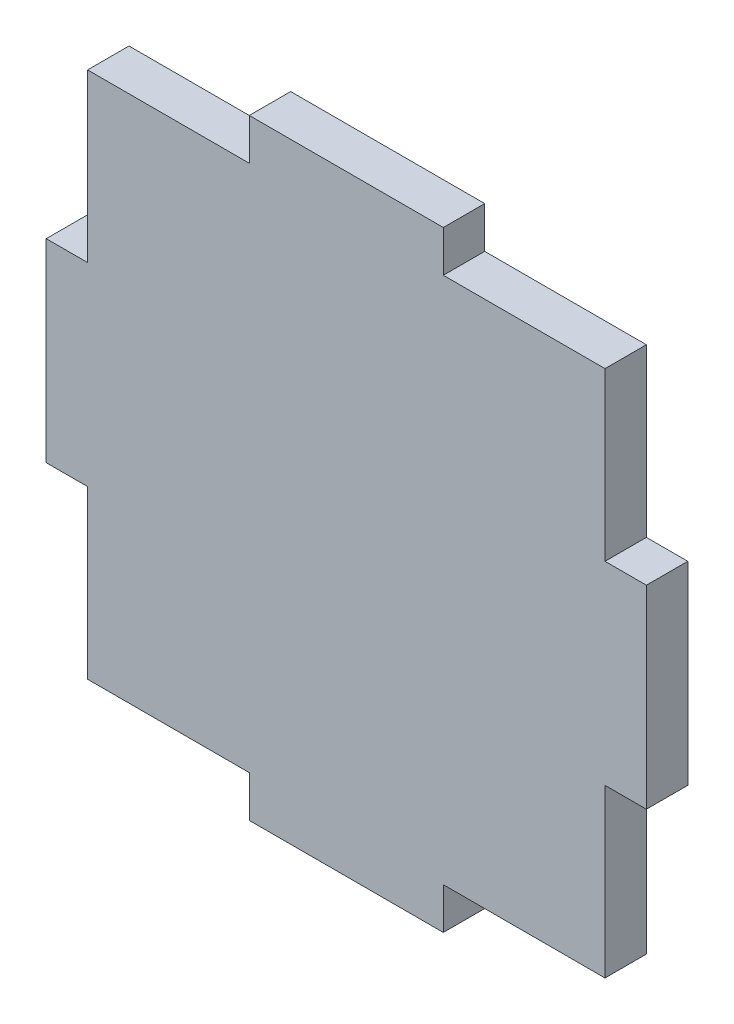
ISO-10303-21;
HEADER;
FILE_DESCRIPTION(('STEP AP214'),'2;1');
FILE_NAME('part.step','',(''),(''),'','','');
FILE_SCHEMA(('AUTOMOTIVE_DESIGN { 1 0 10303 214 1 1 1 1 }'));
ENDSEC;
DATA;
#1=APPLICATION_CONTEXT('core data for automotive mechanical design processes');
#2=APPLICATION_PROTOCOL_DEFINITION('international standard','automotive_design',2000,#1);
#3=PRODUCT_CONTEXT('',#1,'mechanical');
#4=PRODUCT('Part','Part','',(#3));
#5=PRODUCT_RELATED_PRODUCT_CATEGORY('part','',(#4));
#6=PRODUCT_DEFINITION_FORMATION('','',#4);
#7=PRODUCT_DEFINITION_CONTEXT('part definition',#1,'design');
#8=PRODUCT_DEFINITION('design','',#6,#7);
#9=PRODUCT_DEFINITION_SHAPE('','',#8);
#10=(LENGTH_UNIT() NAMED_UNIT(*) SI_UNIT(.MILLI.,.METRE.));
#11=(NAMED_UNIT(*) PLANE_ANGLE_UNIT() SI_UNIT($,.RADIAN.));
#12=(NAMED_UNIT(*) SI_UNIT($,.STERADIAN.) SOLID_ANGLE_UNIT());
#13=UNCERTAINTY_MEASURE_WITH_UNIT(LENGTH_MEASURE(1.E-05),#10,'distance_accuracy_value','');
#14=(GEOMETRIC_REPRESENTATION_CONTEXT(3) GLOBAL_UNCERTAINTY_ASSIGNED_CONTEXT((#13)) GLOBAL_UNIT_ASSIGNED_CONTEXT((#10,
#11,#12)) REPRESENTATION_CONTEXT('',''));
#15=CARTESIAN_POINT('',(0.,0.,0.));
#16=DIRECTION('',(0.,0.,1.));
#17=DIRECTION('',(1.,0.,0.));
#18=AXIS2_PLACEMENT_3D('',#15,#16,#17);
#19=CARTESIAN_POINT('',(4.83987849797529E-13,139.5,16.));
#20=DIRECTION('',(0.,-1.,0.));
#21=DIRECTION('',(1.,0.,0.));
#22=AXIS2_PLACEMENT_3D('',#19,#20,#21);
#23=PLANE('',#22);
#24=DIRECTION('',(-1.,0.,0.));
#25=VECTOR('',#24,1.);
#26=CARTESIAN_POINT('',(4.83987849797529E-13,139.5,0.));
#27=LINE('',#26,#25);
#28=CARTESIAN_POINT('',(0.,139.5,0.));
#29=VERTEX_POINT('',#28);
#30=CARTESIAN_POINT('',(-16.,139.5,0.));
#31=VERTEX_POINT('',#30);
#32=EDGE_CURVE('E380',#29,#31,#27,.T.);
#33=ORIENTED_EDGE('',*,*,#32,.T.);
#34=DIRECTION('',(0.,0.,-1.));
#35=VECTOR('',#34,1.);
#36=CARTESIAN_POINT('',(-16.,139.5,16.));
#37=LINE('',#36,#35);
#38=CARTESIAN_POINT('',(-16.,139.5,16.));
#39=VERTEX_POINT('',#38);
#40=EDGE_CURVE('E116',#39,#31,#37,.T.);
#41=ORIENTED_EDGE('',*,*,#40,.F.);
#42=DIRECTION('',(-1.,0.,0.));
#43=VECTOR('',#42,1.);
#44=CARTESIAN_POINT('',(4.83987849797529E-13,139.5,16.));
#45=LINE('',#44,#43);
#46=CARTESIAN_POINT('',(0.,139.5,16.));
#47=VERTEX_POINT('',#46);
#48=EDGE_CURVE('E411',#47,#39,#45,.T.);
#49=ORIENTED_EDGE('',*,*,#48,.F.);
#50=DIRECTION('',(0.,0.,-1.));
#51=VECTOR('',#50,1.);
#52=CARTESIAN_POINT('',(0.,139.5,16.));
#53=LINE('',#52,#51);
#54=EDGE_CURVE('E12',#47,#29,#53,.T.);
#55=ORIENTED_EDGE('',*,*,#54,.T.);
#56=EDGE_LOOP('',(#33,#41,#49,#55));
#57=FACE_BOUND('',#56,.T.);
#58=ADVANCED_FACE('F106',(#57),#23,.F.);
#59=CARTESIAN_POINT('',(-16.,0.,16.));
#60=DIRECTION('',(1.,0.,0.));
#61=DIRECTION('',(0.,0.,-1.));
#62=AXIS2_PLACEMENT_3D('',#59,#60,#61);
#63=PLANE('',#62);
#64=DIRECTION('',(0.,-1.,0.));
#65=VECTOR('',#64,1.);
#66=CARTESIAN_POINT('',(-16.,0.,0.));
#67=LINE('',#66,#65);
#68=CARTESIAN_POINT('',(-16.,64.5,0.));
#69=VERTEX_POINT('',#68);
#70=EDGE_CURVE('E412',#31,#69,#67,.T.);
#71=ORIENTED_EDGE('',*,*,#70,.T.);
#72=DIRECTION('',(0.,0.,-1.));
#73=VECTOR('',#72,1.);
#74=CARTESIAN_POINT('',(-16.,64.5,16.));
#75=LINE('',#74,#73);
#76=CARTESIAN_POINT('',(-16.,64.5,16.));
#77=VERTEX_POINT('',#76);
#78=EDGE_CURVE('E405',#77,#69,#75,.T.);
#79=ORIENTED_EDGE('',*,*,#78,.F.);
#80=DIRECTION('',(0.,-1.,0.));
#81=VECTOR('',#80,1.);
#82=CARTESIAN_POINT('',(-16.,0.,16.));
#83=LINE('',#82,#81);
#84=EDGE_CURVE('E417',#39,#77,#83,.T.);
#85=ORIENTED_EDGE('',*,*,#84,.F.);
#86=ORIENTED_EDGE('',*,*,#40,.T.);
#87=EDGE_LOOP('',(#71,#79,#85,#86));
#88=FACE_BOUND('',#87,.T.);
#89=ADVANCED_FACE('F429',(#88),#63,.F.);
#90=CARTESIAN_POINT('',(-1.11889664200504E-13,64.5,16.));
#91=DIRECTION('',(0.,-1.,0.));
#92=DIRECTION('',(1.,0.,0.));
#93=AXIS2_PLACEMENT_3D('',#90,#91,#92);
#94=PLANE('',#93);
#95=DIRECTION('',(-1.,0.,0.));
#96=VECTOR('',#95,1.);
#97=CARTESIAN_POINT('',(-1.11889664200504E-13,64.5,0.));
#98=LINE('',#97,#96);
#99=CARTESIAN_POINT('',(0.,64.5,0.));
#100=VERTEX_POINT('',#99);
#101=EDGE_CURVE('E409',#100,#69,#98,.T.);
#102=ORIENTED_EDGE('',*,*,#101,.F.);
#103=DIRECTION('',(0.,0.,-1.));
#104=VECTOR('',#103,1.);
#105=CARTESIAN_POINT('',(0.,64.5,16.));
#106=LINE('',#105,#104);
#107=CARTESIAN_POINT('',(0.,64.5,16.));
#108=VERTEX_POINT('',#107);
#109=EDGE_CURVE('E125',#108,#100,#106,.T.);
#110=ORIENTED_EDGE('',*,*,#109,.F.);
#111=DIRECTION('',(-1.,0.,0.));
#112=VECTOR('',#111,1.);
#113=CARTESIAN_POINT('',(-1.11889664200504E-13,64.5,16.));
#114=LINE('',#113,#112);
#115=EDGE_CURVE('E408',#108,#77,#114,.T.);
#116=ORIENTED_EDGE('',*,*,#115,.T.);
#117=ORIENTED_EDGE('',*,*,#78,.T.);
#118=EDGE_LOOP('',(#102,#110,#116,#117));
#119=FACE_BOUND('',#118,.T.);
#120=ADVANCED_FACE('F430',(#119),#94,.T.);
#121=CARTESIAN_POINT('',(0.,0.,16.));
#122=DIRECTION('',(0.,0.,1.));
#123=DIRECTION('',(1.,0.,0.));
#124=AXIS2_PLACEMENT_3D('',#121,#122,#123);
#125=PLANE('',#124);
#126=ORIENTED_EDGE('',*,*,#115,.F.);
#127=DIRECTION('',(0.,1.,0.));
#128=VECTOR('',#127,1.);
#129=CARTESIAN_POINT('',(0.,0.,16.));
#130=LINE('',#129,#128);
#131=CARTESIAN_POINT('',(0.,0.,16.));
#132=VERTEX_POINT('',#131);
#133=EDGE_CURVE('E254',#132,#108,#130,.T.);
#134=ORIENTED_EDGE('',*,*,#133,.F.);
#135=DIRECTION('',(1.,0.,0.));
#136=VECTOR('',#135,1.);
#137=CARTESIAN_POINT('',(0.,0.,16.));
#138=LINE('',#137,#136);
#139=CARTESIAN_POINT('',(62.5,0.,16.));
#140=VERTEX_POINT('',#139);
#141=EDGE_CURVE('E249',#132,#140,#138,.T.);
#142=ORIENTED_EDGE('',*,*,#141,.T.);
#143=DIRECTION('',(0.,-1.,0.));
#144=VECTOR('',#143,1.);
#145=CARTESIAN_POINT('',(62.5,0.,16.));
#146=LINE('',#145,#144);
#147=CARTESIAN_POINT('',(62.5,-16.,16.));
#148=VERTEX_POINT('',#147);
#149=EDGE_CURVE('E297',#140,#148,#146,.T.);
#150=ORIENTED_EDGE('',*,*,#149,.T.);
#151=DIRECTION('',(1.,0.,0.));
#152=VECTOR('',#151,1.);
#153=CARTESIAN_POINT('',(0.,-16.,16.));
#154=LINE('',#153,#152);
#155=CARTESIAN_POINT('',(137.5,-16.,16.));
#156=VERTEX_POINT('',#155);
#157=EDGE_CURVE('E352',#148,#156,#154,.T.);
#158=ORIENTED_EDGE('',*,*,#157,.T.);
#159=DIRECTION('',(0.,-1.,0.));
#160=VECTOR('',#159,1.);
#161=CARTESIAN_POINT('',(137.5,0.,16.));
#162=LINE('',#161,#160);
#163=CARTESIAN_POINT('',(137.5,0.,16.));
#164=VERTEX_POINT('',#163);
#165=EDGE_CURVE('E292',#164,#156,#162,.T.);
#166=ORIENTED_EDGE('',*,*,#165,.F.);
#167=CARTESIAN_POINT('',(200.,0.,16.));
#168=VERTEX_POINT('',#167);
#169=EDGE_CURVE('E266',#164,#168,#138,.T.);
#170=ORIENTED_EDGE('',*,*,#169,.T.);
#171=DIRECTION('',(0.,1.,0.));
#172=VECTOR('',#171,1.);
#173=CARTESIAN_POINT('',(200.,0.,16.));
#174=LINE('',#173,#172);
#175=CARTESIAN_POINT('',(200.,64.5,16.));
#176=VERTEX_POINT('',#175);
#177=EDGE_CURVE('E308',#168,#176,#174,.T.);
#178=ORIENTED_EDGE('',*,*,#177,.T.);
#179=DIRECTION('',(1.,0.,0.));
#180=VECTOR('',#179,1.);
#181=CARTESIAN_POINT('',(1.11889664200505E-13,64.5000000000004,16.));
#182=LINE('',#181,#180);
#183=CARTESIAN_POINT('',(216.,64.5,16.));
#184=VERTEX_POINT('',#183);
#185=EDGE_CURVE('E347',#176,#184,#182,.T.);
#186=ORIENTED_EDGE('',*,*,#185,.T.);
#187=DIRECTION('',(0.,-1.,0.));
#188=VECTOR('',#187,1.);
#189=CARTESIAN_POINT('',(216.,0.,16.));
#190=LINE('',#189,#188);
#191=CARTESIAN_POINT('',(216.,139.5,16.));
#192=VERTEX_POINT('',#191);
#193=EDGE_CURVE('E339',#192,#184,#190,.T.);
#194=ORIENTED_EDGE('',*,*,#193,.F.);
#195=DIRECTION('',(1.,0.,0.));
#196=VECTOR('',#195,1.);
#197=CARTESIAN_POINT('',(-4.83987849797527E-13,139.499999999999,16.));
#198=LINE('',#197,#196);
#199=CARTESIAN_POINT('',(200.,139.5,16.));
#200=VERTEX_POINT('',#199);
#201=EDGE_CURVE('E374',#200,#192,#198,.T.);
#202=ORIENTED_EDGE('',*,*,#201,.F.);
#203=CARTESIAN_POINT('',(200.,204.,16.));
#204=VERTEX_POINT('',#203);
#205=EDGE_CURVE('E307',#200,#204,#174,.T.);
#206=ORIENTED_EDGE('',*,*,#205,.T.);
#207=DIRECTION('',(1.,0.,0.));
#208=VECTOR('',#207,1.);
#209=CARTESIAN_POINT('',(0.,204.,16.));
#210=LINE('',#209,#208);
#211=CARTESIAN_POINT('',(137.5,204.,16.));
#212=VERTEX_POINT('',#211);
#213=EDGE_CURVE('E311',#212,#204,#210,.T.);
#214=ORIENTED_EDGE('',*,*,#213,.F.);
#215=DIRECTION('',(0.,1.,0.));
#216=VECTOR('',#215,1.);
#217=CARTESIAN_POINT('',(137.5,0.,16.));
#218=LINE('',#217,#216);
#219=CARTESIAN_POINT('',(137.5,220.,16.));
#220=VERTEX_POINT('',#219);
#221=EDGE_CURVE('E391',#212,#220,#218,.T.);
#222=ORIENTED_EDGE('',*,*,#221,.T.);
#223=DIRECTION('',(1.,0.,0.));
#224=VECTOR('',#223,1.);
#225=CARTESIAN_POINT('',(0.,220.,16.));
#226=LINE('',#225,#224);
#227=CARTESIAN_POINT('',(62.5,220.,16.));
#228=VERTEX_POINT('',#227);
#229=EDGE_CURVE('E399',#228,#220,#226,.T.);
#230=ORIENTED_EDGE('',*,*,#229,.F.);
#231=DIRECTION('',(0.,1.,0.));
#232=VECTOR('',#231,1.);
#233=CARTESIAN_POINT('',(62.5,0.,16.));
#234=LINE('',#233,#232);
#235=CARTESIAN_POINT('',(62.5,204.,16.));
#236=VERTEX_POINT('',#235);
#237=EDGE_CURVE('E387',#236,#228,#234,.T.);
#238=ORIENTED_EDGE('',*,*,#237,.F.);
#239=CARTESIAN_POINT('',(0.,204.,16.));
#240=VERTEX_POINT('',#239);
#241=EDGE_CURVE('E312',#240,#236,#210,.T.);
#242=ORIENTED_EDGE('',*,*,#241,.F.);
#243=EDGE_CURVE('E315',#47,#240,#130,.T.);
#244=ORIENTED_EDGE('',*,*,#243,.F.);
#245=ORIENTED_EDGE('',*,*,#48,.T.);
#246=ORIENTED_EDGE('',*,*,#84,.T.);
#247=EDGE_LOOP('',(#126,#134,#142,#150,#158,#166,#170,#178,#186,#194,#202,#206,#214,#222,#230,
#238,#242,#244,#245,#246));
#248=FACE_BOUND('',#247,.T.);
#249=ADVANCED_FACE('F363',(#248),#125,.T.);
#250=CARTESIAN_POINT('',(0.,0.,0.));
#251=DIRECTION('',(0.,0.,1.));
#252=DIRECTION('',(1.,0.,0.));
#253=AXIS2_PLACEMENT_3D('',#250,#251,#252);
#254=PLANE('',#253);
#255=ORIENTED_EDGE('',*,*,#32,.F.);
#256=DIRECTION('',(0.,1.,0.));
#257=VECTOR('',#256,1.);
#258=CARTESIAN_POINT('',(0.,0.,0.));
#259=LINE('',#258,#257);
#260=CARTESIAN_POINT('',(0.,204.,0.));
#261=VERTEX_POINT('',#260);
#262=EDGE_CURVE('E238',#29,#261,#259,.T.);
#263=ORIENTED_EDGE('',*,*,#262,.T.);
#264=DIRECTION('',(1.,0.,0.));
#265=VECTOR('',#264,1.);
#266=CARTESIAN_POINT('',(0.,204.,0.));
#267=LINE('',#266,#265);
#268=CARTESIAN_POINT('',(62.5,204.,0.));
#269=VERTEX_POINT('',#268);
#270=EDGE_CURVE('E269',#261,#269,#267,.T.);
#271=ORIENTED_EDGE('',*,*,#270,.T.);
#272=DIRECTION('',(0.,1.,0.));
#273=VECTOR('',#272,1.);
#274=CARTESIAN_POINT('',(62.5,0.,0.));
#275=LINE('',#274,#273);
#276=CARTESIAN_POINT('',(62.5,220.,0.));
#277=VERTEX_POINT('',#276);
#278=EDGE_CURVE('E388',#269,#277,#275,.T.);
#279=ORIENTED_EDGE('',*,*,#278,.T.);
#280=DIRECTION('',(1.,0.,0.));
#281=VECTOR('',#280,1.);
#282=CARTESIAN_POINT('',(0.,220.,0.));
#283=LINE('',#282,#281);
#284=CARTESIAN_POINT('',(137.5,220.,0.));
#285=VERTEX_POINT('',#284);
#286=EDGE_CURVE('E392',#277,#285,#283,.T.);
#287=ORIENTED_EDGE('',*,*,#286,.T.);
#288=DIRECTION('',(0.,1.,0.));
#289=VECTOR('',#288,1.);
#290=CARTESIAN_POINT('',(137.5,0.,0.));
#291=LINE('',#290,#289);
#292=CARTESIAN_POINT('',(137.5,204.,0.));
#293=VERTEX_POINT('',#292);
#294=EDGE_CURVE('E351',#293,#285,#291,.T.);
#295=ORIENTED_EDGE('',*,*,#294,.F.);
#296=CARTESIAN_POINT('',(200.,204.,0.));
#297=VERTEX_POINT('',#296);
#298=EDGE_CURVE('E317',#293,#297,#267,.T.);
#299=ORIENTED_EDGE('',*,*,#298,.T.);
#300=DIRECTION('',(0.,1.,0.));
#301=VECTOR('',#300,1.);
#302=CARTESIAN_POINT('',(200.,0.,0.));
#303=LINE('',#302,#301);
#304=CARTESIAN_POINT('',(200.,139.5,0.));
#305=VERTEX_POINT('',#304);
#306=EDGE_CURVE('E262',#305,#297,#303,.T.);
#307=ORIENTED_EDGE('',*,*,#306,.F.);
#308=DIRECTION('',(1.,0.,0.));
#309=VECTOR('',#308,1.);
#310=CARTESIAN_POINT('',(-4.83987849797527E-13,139.499999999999,0.));
#311=LINE('',#310,#309);
#312=CARTESIAN_POINT('',(216.,139.5,0.));
#313=VERTEX_POINT('',#312);
#314=EDGE_CURVE('E329',#305,#313,#311,.T.);
#315=ORIENTED_EDGE('',*,*,#314,.T.);
#316=DIRECTION('',(0.,-1.,0.));
#317=VECTOR('',#316,1.);
#318=CARTESIAN_POINT('',(216.,0.,0.));
#319=LINE('',#318,#317);
#320=CARTESIAN_POINT('',(216.,64.5,0.));
#321=VERTEX_POINT('',#320);
#322=EDGE_CURVE('E305',#313,#321,#319,.T.);
#323=ORIENTED_EDGE('',*,*,#322,.T.);
#324=DIRECTION('',(1.,0.,0.));
#325=VECTOR('',#324,1.);
#326=CARTESIAN_POINT('',(1.11889664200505E-13,64.5000000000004,0.));
#327=LINE('',#326,#325);
#328=CARTESIAN_POINT('',(200.,64.5,0.));
#329=VERTEX_POINT('',#328);
#330=EDGE_CURVE('E336',#329,#321,#327,.T.);
#331=ORIENTED_EDGE('',*,*,#330,.F.);
#332=CARTESIAN_POINT('',(200.,0.,0.));
#333=VERTEX_POINT('',#332);
#334=EDGE_CURVE('E316',#333,#329,#303,.T.);
#335=ORIENTED_EDGE('',*,*,#334,.F.);
#336=DIRECTION('',(1.,0.,0.));
#337=VECTOR('',#336,1.);
#338=CARTESIAN_POINT('',(0.,0.,0.));
#339=LINE('',#338,#337);
#340=CARTESIAN_POINT('',(137.5,0.,0.));
#341=VERTEX_POINT('',#340);
#342=EDGE_CURVE('E263',#341,#333,#339,.T.);
#343=ORIENTED_EDGE('',*,*,#342,.F.);
#344=DIRECTION('',(0.,-1.,0.));
#345=VECTOR('',#344,1.);
#346=CARTESIAN_POINT('',(137.5,0.,0.));
#347=LINE('',#346,#345);
#348=CARTESIAN_POINT('',(137.5,-16.,0.));
#349=VERTEX_POINT('',#348);
#350=EDGE_CURVE('E289',#341,#349,#347,.T.);
#351=ORIENTED_EDGE('',*,*,#350,.T.);
#352=DIRECTION('',(1.,0.,0.));
#353=VECTOR('',#352,1.);
#354=CARTESIAN_POINT('',(0.,-16.,0.));
#355=LINE('',#354,#353);
#356=CARTESIAN_POINT('',(62.5,-16.,0.));
#357=VERTEX_POINT('',#356);
#358=EDGE_CURVE('E283',#357,#349,#355,.T.);
#359=ORIENTED_EDGE('',*,*,#358,.F.);
#360=DIRECTION('',(0.,-1.,0.));
#361=VECTOR('',#360,1.);
#362=CARTESIAN_POINT('',(62.5,0.,0.));
#363=LINE('',#362,#361);
#364=CARTESIAN_POINT('',(62.5,0.,0.));
#365=VERTEX_POINT('',#364);
#366=EDGE_CURVE('E261',#365,#357,#363,.T.);
#367=ORIENTED_EDGE('',*,*,#366,.F.);
#368=CARTESIAN_POINT('',(0.,0.,0.));
#369=VERTEX_POINT('',#368);
#370=EDGE_CURVE('E246',#369,#365,#339,.T.);
#371=ORIENTED_EDGE('',*,*,#370,.F.);
#372=EDGE_CURVE('E259',#369,#100,#259,.T.);
#373=ORIENTED_EDGE('',*,*,#372,.T.);
#374=ORIENTED_EDGE('',*,*,#101,.T.);
#375=ORIENTED_EDGE('',*,*,#70,.F.);
#376=EDGE_LOOP('',(#255,#263,#271,#279,#287,#295,#299,#307,#315,#323,#331,#335,#343,#351,#359,
#367,#371,#373,#374,#375));
#377=FACE_BOUND('',#376,.T.);
#378=ADVANCED_FACE('F257',(#377),#254,.F.);
#379=CARTESIAN_POINT('',(0.,220.,16.));
#380=DIRECTION('',(0.,1.,0.));
#381=DIRECTION('',(0.,0.,1.));
#382=AXIS2_PLACEMENT_3D('',#379,#380,#381);
#383=PLANE('',#382);
#384=ORIENTED_EDGE('',*,*,#286,.F.);
#385=DIRECTION('',(0.,0.,-1.));
#386=VECTOR('',#385,1.);
#387=CARTESIAN_POINT('',(62.5,220.,16.));
#388=LINE('',#387,#386);
#389=EDGE_CURVE('E383',#228,#277,#388,.T.);
#390=ORIENTED_EDGE('',*,*,#389,.F.);
#391=ORIENTED_EDGE('',*,*,#229,.T.);
#392=DIRECTION('',(0.,0.,-1.));
#393=VECTOR('',#392,1.);
#394=CARTESIAN_POINT('',(137.5,220.,16.));
#395=LINE('',#394,#393);
#396=EDGE_CURVE('E381',#220,#285,#395,.T.);
#397=ORIENTED_EDGE('',*,*,#396,.T.);
#398=EDGE_LOOP('',(#384,#390,#391,#397));
#399=FACE_BOUND('',#398,.T.);
#400=ADVANCED_FACE('F444',(#399),#383,.T.);
#401=CARTESIAN_POINT('',(137.5,0.,16.));
#402=DIRECTION('',(-1.,0.,0.));
#403=DIRECTION('',(0.,0.,1.));
#404=AXIS2_PLACEMENT_3D('',#401,#402,#403);
#405=PLANE('',#404);
#406=ORIENTED_EDGE('',*,*,#294,.T.);
#407=ORIENTED_EDGE('',*,*,#396,.F.);
#408=ORIENTED_EDGE('',*,*,#221,.F.);
#409=DIRECTION('',(0.,0.,-1.));
#410=VECTOR('',#409,1.);
#411=CARTESIAN_POINT('',(137.5,204.,16.));
#412=LINE('',#411,#410);
#413=EDGE_CURVE('E378',#212,#293,#412,.T.);
#414=ORIENTED_EDGE('',*,*,#413,.T.);
#415=EDGE_LOOP('',(#406,#407,#408,#414));
#416=FACE_BOUND('',#415,.T.);
#417=ADVANCED_FACE('F539',(#416),#405,.F.);
#418=CARTESIAN_POINT('',(-4.83987849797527E-13,139.499999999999,16.));
#419=DIRECTION('',(0.,1.,0.));
#420=DIRECTION('',(-1.,0.,0.));
#421=AXIS2_PLACEMENT_3D('',#418,#419,#420);
#422=PLANE('',#421);
#423=ORIENTED_EDGE('',*,*,#314,.F.);
#424=DIRECTION('',(0.,0.,-1.));
#425=VECTOR('',#424,1.);
#426=CARTESIAN_POINT('',(200.,139.5,16.));
#427=LINE('',#426,#425);
#428=EDGE_CURVE('E325',#200,#305,#427,.T.);
#429=ORIENTED_EDGE('',*,*,#428,.F.);
#430=ORIENTED_EDGE('',*,*,#201,.T.);
#431=DIRECTION('',(0.,0.,-1.));
#432=VECTOR('',#431,1.);
#433=CARTESIAN_POINT('',(216.,139.5,16.));
#434=LINE('',#433,#432);
#435=EDGE_CURVE('E334',#192,#313,#434,.T.);
#436=ORIENTED_EDGE('',*,*,#435,.T.);
#437=EDGE_LOOP('',(#423,#429,#430,#436));
#438=FACE_BOUND('',#437,.T.);
#439=ADVANCED_FACE('F332',(#438),#422,.T.);
#440=CARTESIAN_POINT('',(216.,0.,16.));
#441=DIRECTION('',(1.,0.,0.));
#442=DIRECTION('',(0.,0.,-1.));
#443=AXIS2_PLACEMENT_3D('',#440,#441,#442);
#444=PLANE('',#443);
#445=ORIENTED_EDGE('',*,*,#322,.F.);
#446=ORIENTED_EDGE('',*,*,#435,.F.);
#447=ORIENTED_EDGE('',*,*,#193,.T.);
#448=DIRECTION('',(0.,0.,-1.));
#449=VECTOR('',#448,1.);
#450=CARTESIAN_POINT('',(216.,64.5,16.));
#451=LINE('',#450,#449);
#452=EDGE_CURVE('E344',#184,#321,#451,.T.);
#453=ORIENTED_EDGE('',*,*,#452,.T.);
#454=EDGE_LOOP('',(#445,#446,#447,#453));
#455=FACE_BOUND('',#454,.T.);
#456=ADVANCED_FACE('F446',(#455),#444,.T.);
#457=CARTESIAN_POINT('',(1.11889664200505E-13,64.5000000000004,16.));
#458=DIRECTION('',(0.,1.,0.));
#459=DIRECTION('',(-1.,0.,0.));
#460=AXIS2_PLACEMENT_3D('',#457,#458,#459);
#461=PLANE('',#460);
#462=ORIENTED_EDGE('',*,*,#330,.T.);
#463=ORIENTED_EDGE('',*,*,#452,.F.);
#464=ORIENTED_EDGE('',*,*,#185,.F.);
#465=DIRECTION('',(0.,0.,-1.));
#466=VECTOR('',#465,1.);
#467=CARTESIAN_POINT('',(200.,64.5,16.));
#468=LINE('',#467,#466);
#469=EDGE_CURVE('E346',#176,#329,#468,.T.);
#470=ORIENTED_EDGE('',*,*,#469,.T.);
#471=EDGE_LOOP('',(#462,#463,#464,#470));
#472=FACE_BOUND('',#471,.T.);
#473=ADVANCED_FACE('F371',(#472),#461,.F.);
#474=CARTESIAN_POINT('',(137.5,0.,16.));
#475=DIRECTION('',(1.,0.,0.));
#476=DIRECTION('',(0.,0.,-1.));
#477=AXIS2_PLACEMENT_3D('',#474,#475,#476);
#478=PLANE('',#477);
#479=ORIENTED_EDGE('',*,*,#350,.F.);
#480=DIRECTION('',(0.,0.,-1.));
#481=VECTOR('',#480,1.);
#482=CARTESIAN_POINT('',(137.5,0.,16.));
#483=LINE('',#482,#481);
#484=EDGE_CURVE('E298',#164,#341,#483,.T.);
#485=ORIENTED_EDGE('',*,*,#484,.F.);
#486=ORIENTED_EDGE('',*,*,#165,.T.);
#487=DIRECTION('',(0.,0.,-1.));
#488=VECTOR('',#487,1.);
#489=CARTESIAN_POINT('',(137.5,-16.,16.));
#490=LINE('',#489,#488);
#491=EDGE_CURVE('E300',#156,#349,#490,.T.);
#492=ORIENTED_EDGE('',*,*,#491,.T.);
#493=EDGE_LOOP('',(#479,#485,#486,#492));
#494=FACE_BOUND('',#493,.T.);
#495=ADVANCED_FACE('F360',(#494),#478,.T.);
#496=CARTESIAN_POINT('',(0.,-16.,16.));
#497=DIRECTION('',(0.,1.,0.));
#498=DIRECTION('',(0.,0.,1.));
#499=AXIS2_PLACEMENT_3D('',#496,#497,#498);
#500=PLANE('',#499);
#501=ORIENTED_EDGE('',*,*,#358,.T.);
#502=ORIENTED_EDGE('',*,*,#491,.F.);
#503=ORIENTED_EDGE('',*,*,#157,.F.);
#504=DIRECTION('',(0.,0.,-1.));
#505=VECTOR('',#504,1.);
#506=CARTESIAN_POINT('',(62.5,-16.,16.));
#507=LINE('',#506,#505);
#508=EDGE_CURVE('E302',#148,#357,#507,.T.);
#509=ORIENTED_EDGE('',*,*,#508,.T.);
#510=EDGE_LOOP('',(#501,#502,#503,#509));
#511=FACE_BOUND('',#510,.T.);
#512=ADVANCED_FACE('F434',(#511),#500,.F.);
#513=CARTESIAN_POINT('',(62.5,0.,16.));
#514=DIRECTION('',(-1.,0.,0.));
#515=DIRECTION('',(0.,0.,1.));
#516=AXIS2_PLACEMENT_3D('',#513,#514,#515);
#517=PLANE('',#516);
#518=ORIENTED_EDGE('',*,*,#278,.F.);
#519=DIRECTION('',(0.,0.,-1.));
#520=VECTOR('',#519,1.);
#521=CARTESIAN_POINT('',(62.5,204.,16.));
#522=LINE('',#521,#520);
#523=EDGE_CURVE('E385',#236,#269,#522,.T.);
#524=ORIENTED_EDGE('',*,*,#523,.F.);
#525=ORIENTED_EDGE('',*,*,#237,.T.);
#526=ORIENTED_EDGE('',*,*,#389,.T.);
#527=EDGE_LOOP('',(#518,#524,#525,#526));
#528=FACE_BOUND('',#527,.T.);
#529=ADVANCED_FACE('F436',(#528),#517,.T.);
#530=CARTESIAN_POINT('',(62.5,0.,16.));
#531=DIRECTION('',(1.,0.,0.));
#532=DIRECTION('',(0.,0.,-1.));
#533=AXIS2_PLACEMENT_3D('',#530,#531,#532);
#534=PLANE('',#533);
#535=ORIENTED_EDGE('',*,*,#366,.T.);
#536=ORIENTED_EDGE('',*,*,#508,.F.);
#537=ORIENTED_EDGE('',*,*,#149,.F.);
#538=DIRECTION('',(0.,0.,-1.));
#539=VECTOR('',#538,1.);
#540=CARTESIAN_POINT('',(62.5,0.,16.));
#541=LINE('',#540,#539);
#542=EDGE_CURVE('E304',#140,#365,#541,.T.);
#543=ORIENTED_EDGE('',*,*,#542,.T.);
#544=EDGE_LOOP('',(#535,#536,#537,#543));
#545=FACE_BOUND('',#544,.T.);
#546=ADVANCED_FACE('F432',(#545),#534,.F.);
#547=CARTESIAN_POINT('',(0.,204.,16.));
#548=DIRECTION('',(0.,1.,0.));
#549=DIRECTION('',(0.,0.,1.));
#550=AXIS2_PLACEMENT_3D('',#547,#548,#549);
#551=PLANE('',#550);
#552=ORIENTED_EDGE('',*,*,#413,.F.);
#553=ORIENTED_EDGE('',*,*,#213,.T.);
#554=DIRECTION('',(0.,0.,-1.));
#555=VECTOR('',#554,1.);
#556=CARTESIAN_POINT('',(200.,204.,16.));
#557=LINE('',#556,#555);
#558=EDGE_CURVE('E273',#204,#297,#557,.T.);
#559=ORIENTED_EDGE('',*,*,#558,.T.);
#560=ORIENTED_EDGE('',*,*,#298,.F.);
#561=EDGE_LOOP('',(#552,#553,#559,#560));
#562=FACE_BOUND('',#561,.T.);
#563=ADVANCED_FACE('F449',(#562),#551,.T.);
#564=CARTESIAN_POINT('',(200.,0.,16.));
#565=DIRECTION('',(-1.,0.,0.));
#566=DIRECTION('',(0.,0.,1.));
#567=AXIS2_PLACEMENT_3D('',#564,#565,#566);
#568=PLANE('',#567);
#569=ORIENTED_EDGE('',*,*,#205,.F.);
#570=ORIENTED_EDGE('',*,*,#428,.T.);
#571=ORIENTED_EDGE('',*,*,#306,.T.);
#572=ORIENTED_EDGE('',*,*,#558,.F.);
#573=EDGE_LOOP('',(#569,#570,#571,#572));
#574=FACE_BOUND('',#573,.T.);
#575=ADVANCED_FACE('F324',(#574),#568,.F.);
#576=ORIENTED_EDGE('',*,*,#469,.F.);
#577=ORIENTED_EDGE('',*,*,#177,.F.);
#578=DIRECTION('',(0.,0.,-1.));
#579=VECTOR('',#578,1.);
#580=CARTESIAN_POINT('',(200.,0.,16.));
#581=LINE('',#580,#579);
#582=EDGE_CURVE('E110',#168,#333,#581,.T.);
#583=ORIENTED_EDGE('',*,*,#582,.T.);
#584=ORIENTED_EDGE('',*,*,#334,.T.);
#585=EDGE_LOOP('',(#576,#577,#583,#584));
#586=FACE_BOUND('',#585,.T.);
#587=ADVANCED_FACE('F366',(#586),#568,.F.);
#588=CARTESIAN_POINT('',(0.,0.,16.));
#589=DIRECTION('',(0.,1.,0.));
#590=DIRECTION('',(0.,0.,1.));
#591=AXIS2_PLACEMENT_3D('',#588,#589,#590);
#592=PLANE('',#591);
#593=ORIENTED_EDGE('',*,*,#169,.F.);
#594=ORIENTED_EDGE('',*,*,#484,.T.);
#595=ORIENTED_EDGE('',*,*,#342,.T.);
#596=ORIENTED_EDGE('',*,*,#582,.F.);
#597=EDGE_LOOP('',(#593,#594,#595,#596));
#598=FACE_BOUND('',#597,.T.);
#599=ADVANCED_FACE('F367',(#598),#592,.F.);
#600=ORIENTED_EDGE('',*,*,#241,.T.);
#601=ORIENTED_EDGE('',*,*,#523,.T.);
#602=ORIENTED_EDGE('',*,*,#270,.F.);
#603=DIRECTION('',(0.,0.,-1.));
#604=VECTOR('',#603,1.);
#605=CARTESIAN_POINT('',(0.,204.,16.));
#606=LINE('',#605,#604);
#607=EDGE_CURVE('E253',#240,#261,#606,.T.);
#608=ORIENTED_EDGE('',*,*,#607,.F.);
#609=EDGE_LOOP('',(#600,#601,#602,#608));
#610=FACE_BOUND('',#609,.T.);
#611=ADVANCED_FACE('F457',(#610),#551,.T.);
#612=ORIENTED_EDGE('',*,*,#542,.F.);
#613=ORIENTED_EDGE('',*,*,#141,.F.);
#614=DIRECTION('',(0.,0.,-1.));
#615=VECTOR('',#614,1.);
#616=CARTESIAN_POINT('',(0.,0.,16.));
#617=LINE('',#616,#615);
#618=EDGE_CURVE('E244',#132,#369,#617,.T.);
#619=ORIENTED_EDGE('',*,*,#618,.T.);
#620=ORIENTED_EDGE('',*,*,#370,.T.);
#621=EDGE_LOOP('',(#612,#613,#619,#620));
#622=FACE_BOUND('',#621,.T.);
#623=ADVANCED_FACE('F108',(#622),#592,.F.);
#624=CARTESIAN_POINT('',(0.,0.,16.));
#625=DIRECTION('',(-1.,0.,0.));
#626=DIRECTION('',(0.,0.,1.));
#627=AXIS2_PLACEMENT_3D('',#624,#625,#626);
#628=PLANE('',#627);
#629=ORIENTED_EDGE('',*,*,#133,.T.);
#630=ORIENTED_EDGE('',*,*,#109,.T.);
#631=ORIENTED_EDGE('',*,*,#372,.F.);
#632=ORIENTED_EDGE('',*,*,#618,.F.);
#633=EDGE_LOOP('',(#629,#630,#631,#632));
#634=FACE_BOUND('',#633,.T.);
#635=ADVANCED_FACE('F265',(#634),#628,.T.);
#636=ORIENTED_EDGE('',*,*,#54,.F.);
#637=ORIENTED_EDGE('',*,*,#243,.T.);
#638=ORIENTED_EDGE('',*,*,#607,.T.);
#639=ORIENTED_EDGE('',*,*,#262,.F.);
#640=EDGE_LOOP('',(#636,#637,#638,#639));
#641=FACE_BOUND('',#640,.T.);
#642=ADVANCED_FACE('F450',(#641),#628,.T.);
#643=CLOSED_SHELL('',(#58,#89,#120,#249,#378,#400,#417,#439,#456,#473,#495,#512,#529,#546,#563,
#575,#587,#599,#611,#623,#635,#642));
#644=MANIFOLD_SOLID_BREP('B2',#643);
#645=ADVANCED_BREP_SHAPE_REPRESENTATION('',(#18,#644),#14);
#646=SHAPE_DEFINITION_REPRESENTATION(#9,#645);
ENDSEC;
END-ISO-10303-21;
